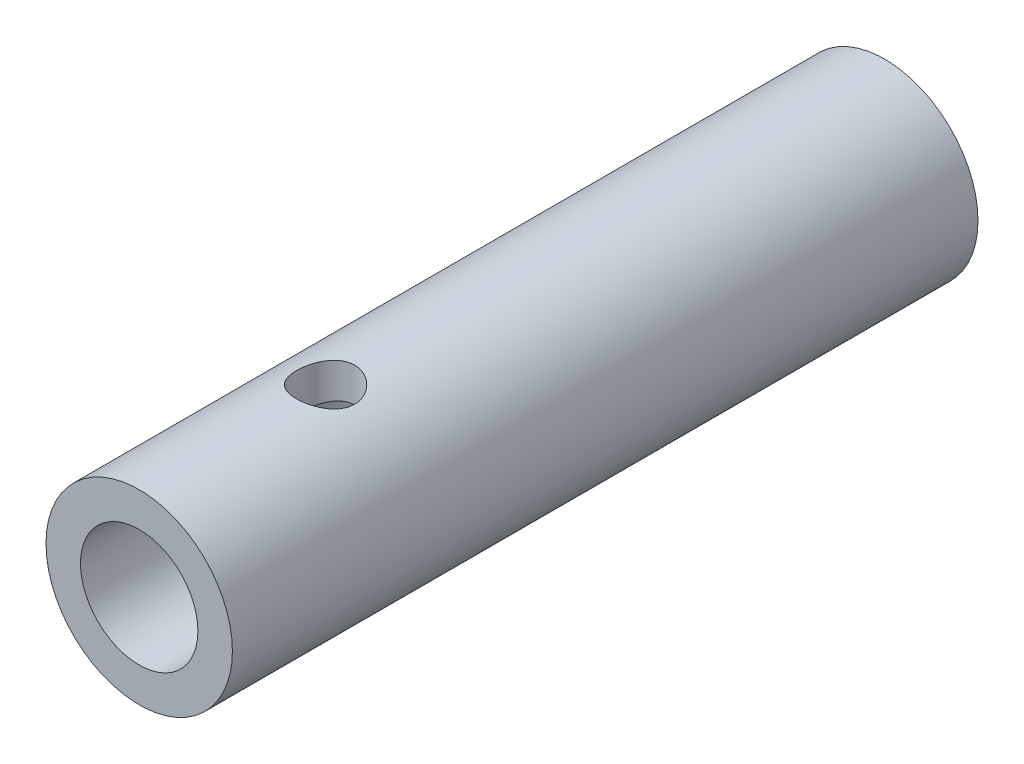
from build123d import *

# Parameters (mm, degrees)
SKETCH1_R           = 3.175
BOSS_EXTRUDE1_DEPTH = 12.7
SKETCH2_R           = 2
CUT_EXTRUDE1_DEPTH  = 9.525
SKETCH3_R           = 0.9921875
CUT_EXTRUDE2_DEPTH  = 9.525


with BuildPart() as part:
    # Sketch1 → Boss-Extrude1 (new, symmetric)
    with BuildSketch(Plane.XY):
        Circle(SKETCH1_R)
    extrude(amount=BOSS_EXTRUDE1_DEPTH, both=True)

    # Sketch2 → Cut-Extrude1 (cut)
    with BuildSketch(Plane.XY.offset(12.7)):
        Circle(SKETCH2_R)
    extrude(amount=-CUT_EXTRUDE1_DEPTH, mode=Mode.SUBTRACT)

    # Sketch3 → Cut-Extrude2 (cut)
    with BuildSketch(Plane(origin=(0, 0, 0), x_dir=(1, 0, 0), z_dir=(0, 1, 0))):
        with Locations(Location((0, -6.35, 0), (0, 0, 90))):
            Circle(SKETCH3_R)
    extrude(amount=CUT_EXTRUDE2_DEPTH, mode=Mode.SUBTRACT)


solid = part.part
